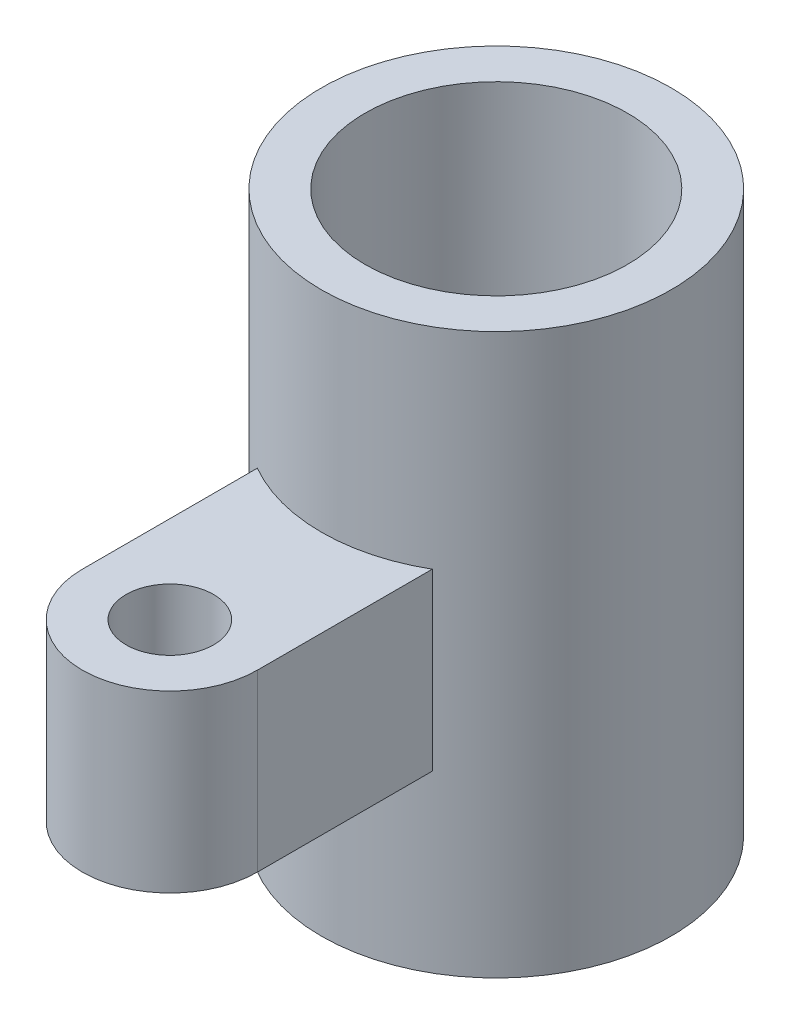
from build123d import *

# Parameters (mm, degrees)
CROQUIS1_R              = 20
CROQUIS1_R_2            = 15
SALIENTE_EXTRUIR1_DEPTH = 64
SALIENTE_EXTRUIR2_START = 20
CROQUIS2_R              = 5
SALIENTE_EXTRUIR2_DEPTH = 20


with BuildPart() as part:
    # Croquis1 → Saliente-Extruir1 (new body)
    with BuildSketch(Plane(origin=(0, 0, 0), x_dir=(1, 0, 0), z_dir=(0, 1, 0))):
        with Locations(Location((0, 0, 0), (0, 0, 270))):
            Circle(CROQUIS1_R)
        with Locations(Location((0, 0, 0), (0, 0, 270))):
            Circle(CROQUIS1_R_2, mode=Mode.SUBTRACT)
    extrude(amount=SALIENTE_EXTRUIR1_DEPTH)

    # Croquis2 → Saliente-Extruir2 (add)
    with BuildSketch(Plane(origin=(0, 0, 0), x_dir=(1, 0, 0), z_dir=(0, 1, 0)).offset(SALIENTE_EXTRUIR2_START)):
        with BuildLine():
            Line((-10, -17.320508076), (10, -17.320508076))
            Line((10, -17.320508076), (10, -37.320508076))
            ThreePointArc((10, -37.320508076), (0, -47.320508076), (-10, -37.320508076))
            Line((-10, -37.320508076), (-10, -17.320508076))
        make_face()
        with Locations(Location((0, -37.320508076, 0), (0, 0, 270))):
            Circle(CROQUIS2_R, mode=Mode.SUBTRACT)
    extrude(amount=SALIENTE_EXTRUIR2_DEPTH)


solid = part.part
